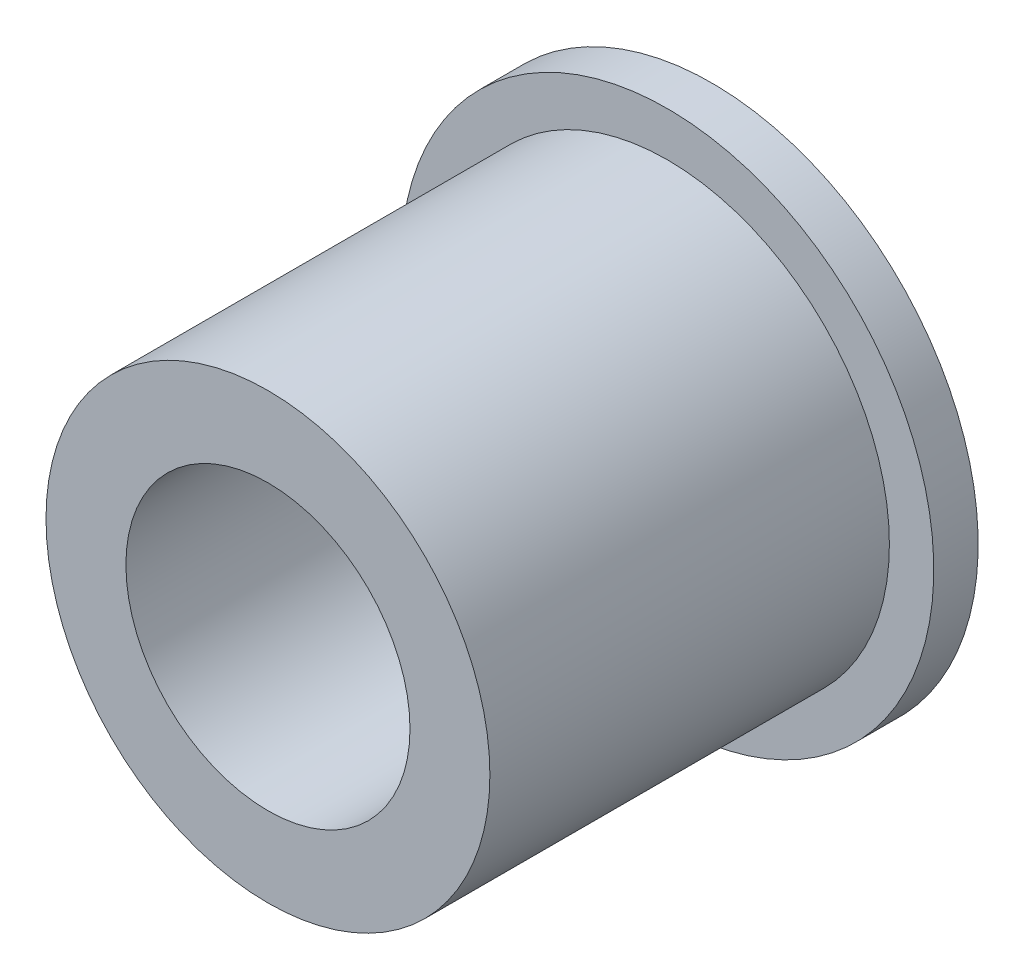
ISO-10303-21;
HEADER;
FILE_DESCRIPTION(('STEP AP214'),'2;1');
FILE_NAME('part.step','',(''),(''),'','','');
FILE_SCHEMA(('AUTOMOTIVE_DESIGN { 1 0 10303 214 1 1 1 1 }'));
ENDSEC;
DATA;
#1=APPLICATION_CONTEXT('core data for automotive mechanical design processes');
#2=APPLICATION_PROTOCOL_DEFINITION('international standard','automotive_design',2000,#1);
#3=PRODUCT_CONTEXT('',#1,'mechanical');
#4=PRODUCT('Part','Part','',(#3));
#5=PRODUCT_RELATED_PRODUCT_CATEGORY('part','',(#4));
#6=PRODUCT_DEFINITION_FORMATION('','',#4);
#7=PRODUCT_DEFINITION_CONTEXT('part definition',#1,'design');
#8=PRODUCT_DEFINITION('design','',#6,#7);
#9=PRODUCT_DEFINITION_SHAPE('','',#8);
#10=(LENGTH_UNIT() NAMED_UNIT(*) SI_UNIT(.MILLI.,.METRE.));
#11=(NAMED_UNIT(*) PLANE_ANGLE_UNIT() SI_UNIT($,.RADIAN.));
#12=(NAMED_UNIT(*) SI_UNIT($,.STERADIAN.) SOLID_ANGLE_UNIT());
#13=UNCERTAINTY_MEASURE_WITH_UNIT(LENGTH_MEASURE(1.E-05),#10,'distance_accuracy_value','');
#14=(GEOMETRIC_REPRESENTATION_CONTEXT(3) GLOBAL_UNCERTAINTY_ASSIGNED_CONTEXT((#13)) GLOBAL_UNIT_ASSIGNED_CONTEXT((#10,
#11,#12)) REPRESENTATION_CONTEXT('',''));
#15=CARTESIAN_POINT('',(0.,0.,0.));
#16=DIRECTION('',(0.,0.,1.));
#17=DIRECTION('',(1.,0.,0.));
#18=AXIS2_PLACEMENT_3D('',#15,#16,#17);
#19=CARTESIAN_POINT('',(0.,0.,50.));
#20=DIRECTION('',(0.,0.,-1.));
#21=DIRECTION('',(-1.,0.,0.));
#22=AXIS2_PLACEMENT_3D('',#19,#20,#21);
#23=CYLINDRICAL_SURFACE('',#22,25.);
#24=CARTESIAN_POINT('',(0.,0.,50.));
#25=DIRECTION('',(0.,0.,1.));
#26=DIRECTION('',(1.,0.,0.));
#27=AXIS2_PLACEMENT_3D('',#24,#25,#26);
#28=CIRCLE('',#27,25.);
#29=CARTESIAN_POINT('',(25.,0.,50.));
#30=VERTEX_POINT('',#29);
#31=EDGE_CURVE('E36',#30,#30,#28,.T.);
#32=ORIENTED_EDGE('',*,*,#31,.F.);
#33=EDGE_LOOP('',(#32));
#34=FACE_BOUND('',#33,.T.);
#35=CARTESIAN_POINT('',(0.,0.,5.));
#36=DIRECTION('',(0.,0.,-1.));
#37=DIRECTION('',(-1.,0.,0.));
#38=AXIS2_PLACEMENT_3D('',#35,#36,#37);
#39=CIRCLE('',#38,25.);
#40=CARTESIAN_POINT('',(-25.,0.,5.));
#41=VERTEX_POINT('',#40);
#42=EDGE_CURVE('E10',#41,#41,#39,.T.);
#43=ORIENTED_EDGE('',*,*,#42,.F.);
#44=EDGE_LOOP('',(#43));
#45=FACE_BOUND('',#44,.T.);
#46=ADVANCED_FACE('F30',(#34,#45),#23,.T.);
#47=CARTESIAN_POINT('',(0.,0.,50.));
#48=DIRECTION('',(0.,0.,1.));
#49=DIRECTION('',(1.,0.,0.));
#50=AXIS2_PLACEMENT_3D('',#47,#48,#49);
#51=PLANE('',#50);
#52=ORIENTED_EDGE('',*,*,#31,.T.);
#53=EDGE_LOOP('',(#52));
#54=FACE_BOUND('',#53,.T.);
#55=CARTESIAN_POINT('',(0.,0.,50.));
#56=DIRECTION('',(0.,0.,1.));
#57=DIRECTION('',(1.,0.,0.));
#58=AXIS2_PLACEMENT_3D('',#55,#56,#57);
#59=CIRCLE('',#58,16.);
#60=CARTESIAN_POINT('',(16.,0.,50.));
#61=VERTEX_POINT('',#60);
#62=EDGE_CURVE('E40',#61,#61,#59,.T.);
#63=ORIENTED_EDGE('',*,*,#62,.F.);
#64=EDGE_LOOP('',(#63));
#65=FACE_BOUND('',#64,.T.);
#66=ADVANCED_FACE('F72',(#54,#65),#51,.T.);
#67=CARTESIAN_POINT('',(0.,0.,0.));
#68=DIRECTION('',(0.,0.,1.));
#69=DIRECTION('',(1.,0.,0.));
#70=AXIS2_PLACEMENT_3D('',#67,#68,#69);
#71=PLANE('',#70);
#72=CARTESIAN_POINT('',(0.,0.,0.));
#73=DIRECTION('',(0.,0.,1.));
#74=DIRECTION('',(1.,0.,0.));
#75=AXIS2_PLACEMENT_3D('',#72,#73,#74);
#76=CIRCLE('',#75,16.);
#77=CARTESIAN_POINT('',(16.,0.,0.));
#78=VERTEX_POINT('',#77);
#79=EDGE_CURVE('E44',#78,#78,#76,.T.);
#80=ORIENTED_EDGE('',*,*,#79,.T.);
#81=EDGE_LOOP('',(#80));
#82=FACE_BOUND('',#81,.T.);
#83=CARTESIAN_POINT('',(0.,0.,0.));
#84=DIRECTION('',(0.,0.,-1.));
#85=DIRECTION('',(-1.,0.,0.));
#86=AXIS2_PLACEMENT_3D('',#83,#84,#85);
#87=CIRCLE('',#86,30.);
#88=CARTESIAN_POINT('',(-30.,0.,0.));
#89=VERTEX_POINT('',#88);
#90=EDGE_CURVE('E52',#89,#89,#87,.T.);
#91=ORIENTED_EDGE('',*,*,#90,.T.);
#92=EDGE_LOOP('',(#91));
#93=FACE_BOUND('',#92,.T.);
#94=ADVANCED_FACE('F56',(#82,#93),#71,.F.);
#95=CARTESIAN_POINT('',(0.,0.,50.));
#96=DIRECTION('',(0.,0.,-1.));
#97=DIRECTION('',(-1.,0.,0.));
#98=AXIS2_PLACEMENT_3D('',#95,#96,#97);
#99=CYLINDRICAL_SURFACE('',#98,16.);
#100=ORIENTED_EDGE('',*,*,#62,.T.);
#101=EDGE_LOOP('',(#100));
#102=FACE_BOUND('',#101,.T.);
#103=ORIENTED_EDGE('',*,*,#79,.F.);
#104=EDGE_LOOP('',(#103));
#105=FACE_BOUND('',#104,.T.);
#106=ADVANCED_FACE('F61',(#102,#105),#99,.F.);
#107=CARTESIAN_POINT('',(0.,0.,5.));
#108=DIRECTION('',(0.,0.,-1.));
#109=DIRECTION('',(-1.,0.,0.));
#110=AXIS2_PLACEMENT_3D('',#107,#108,#109);
#111=CYLINDRICAL_SURFACE('',#110,30.);
#112=CARTESIAN_POINT('',(0.,0.,5.));
#113=DIRECTION('',(0.,0.,-1.));
#114=DIRECTION('',(-1.,0.,0.));
#115=AXIS2_PLACEMENT_3D('',#112,#113,#114);
#116=CIRCLE('',#115,30.);
#117=CARTESIAN_POINT('',(-30.,0.,5.));
#118=VERTEX_POINT('',#117);
#119=EDGE_CURVE('E49',#118,#118,#116,.T.);
#120=ORIENTED_EDGE('',*,*,#119,.T.);
#121=EDGE_LOOP('',(#120));
#122=FACE_BOUND('',#121,.T.);
#123=ORIENTED_EDGE('',*,*,#90,.F.);
#124=EDGE_LOOP('',(#123));
#125=FACE_BOUND('',#124,.T.);
#126=ADVANCED_FACE('F58',(#122,#125),#111,.T.);
#127=CARTESIAN_POINT('',(0.,0.,5.));
#128=DIRECTION('',(0.,0.,-1.));
#129=DIRECTION('',(-1.,0.,0.));
#130=AXIS2_PLACEMENT_3D('',#127,#128,#129);
#131=PLANE('',#130);
#132=ORIENTED_EDGE('',*,*,#42,.T.);
#133=EDGE_LOOP('',(#132));
#134=FACE_BOUND('',#133,.T.);
#135=ORIENTED_EDGE('',*,*,#119,.F.);
#136=EDGE_LOOP('',(#135));
#137=FACE_BOUND('',#136,.T.);
#138=ADVANCED_FACE('F60',(#134,#137),#131,.F.);
#139=CLOSED_SHELL('',(#46,#66,#94,#106,#126,#138));
#140=MANIFOLD_SOLID_BREP('B2',#139);
#141=ADVANCED_BREP_SHAPE_REPRESENTATION('',(#18,#140),#14);
#142=SHAPE_DEFINITION_REPRESENTATION(#9,#141);
ENDSEC;
END-ISO-10303-21;
